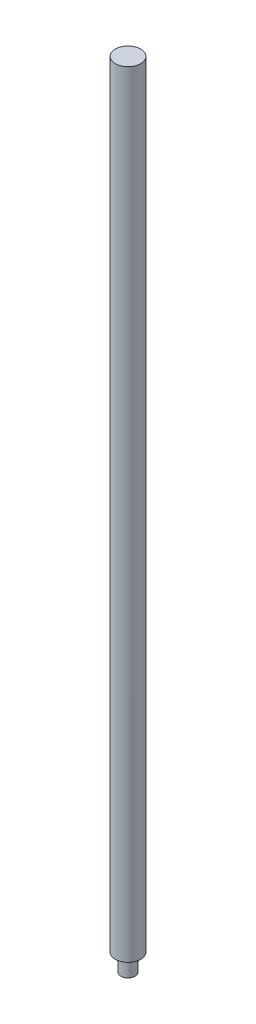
from build123d import *

# Parameters (mm, degrees)
SKETCH_1_R          = 8
EXTRUDE_1_DEPTH     = 500
SKETCH_2_OUTSIDE_W  = 118.102
SKETCH_2_OUTSIDE_H  = 118.102
SKETCH_2_OUTSIDE_R  = 4.5
CUT_EXTRUDE_1_DEPTH = 11


with BuildPart() as part:
    # Sketch 1 → Extrude 1 (new body)
    with BuildSketch(Plane(origin=(0, 0, 0), x_dir=(1, 0, 0), z_dir=(0, 1, 0))):
        with Locations(Location((0, 0, 0), (0, 0, 270))):
            Circle(SKETCH_1_R)
    extrude(amount=EXTRUDE_1_DEPTH)

    # Sketch 2 outside → Cut-Extrude 1 (cut)
    with BuildSketch(Plane.XZ):
        Rectangle(SKETCH_2_OUTSIDE_W, SKETCH_2_OUTSIDE_H)
        with Locations(Location((0, 0, 0), (0, 0, 270))):
            Circle(SKETCH_2_OUTSIDE_R, mode=Mode.SUBTRACT)
    extrude(amount=-CUT_EXTRUDE_1_DEPTH, mode=Mode.SUBTRACT)


solid = part.part
